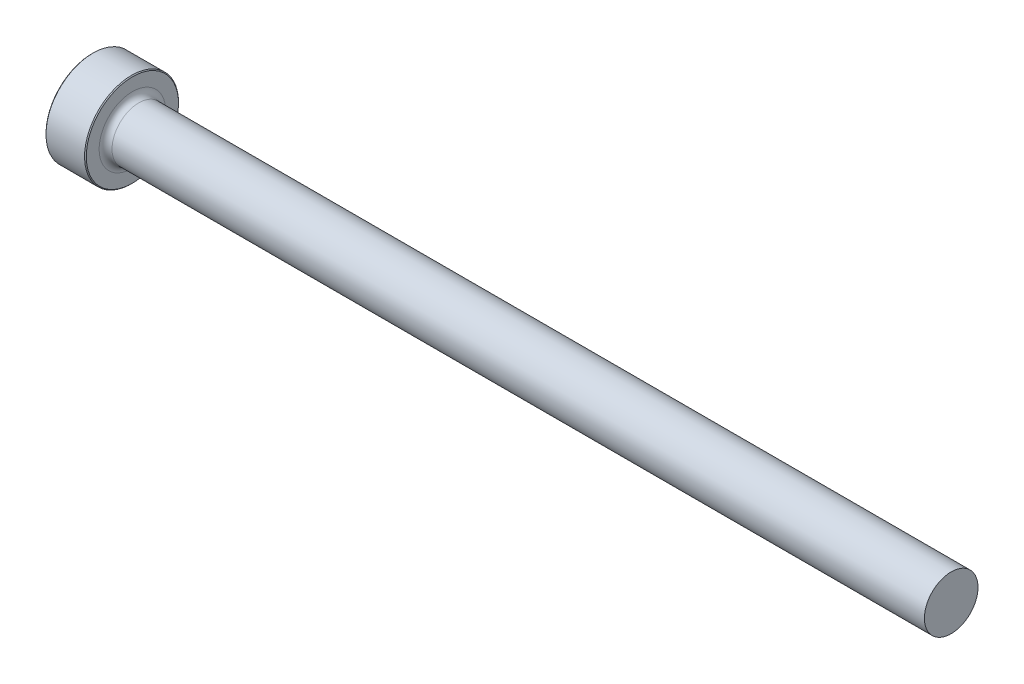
from build123d import *

# Parameters (mm, degrees)
CHAMFER1_SIZE = 0.1016


with BuildPart() as part:
    # Sketch1 → Revolve1 (revolve)
    with BuildSketch(Plane.XY):
        with BuildLine():
            Line((0, 0), (0, 5.55625))
            Line((0, 5.55625), (4.7625, 5.55625))
            Line((4.7625, 5.55625), (4.7625, 3.93319))
            ThreePointArc((4.7625, 3.93319), (4.985684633, 3.394374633), (5.5245, 3.17119))
            Line((5.5245, 3.17119), (101.6, 3.17119))
            Line((101.6, 3.17119), (101.6, 0))
            Line((101.6, 0), (0, 0))
        make_face()
    revolve(axis=Axis((101.6, 0, 0), (-1, 0, 0)))

    # Chamfer1
    chamfer1_edges = [part.edges().sort_by_distance(p)[0] for p in [
        (0, -5.55625, 0),
        (4.7625, -5.55625, 0),
    ]]
    chamfer(chamfer1_edges, length=CHAMFER1_SIZE)


solid = part.part
